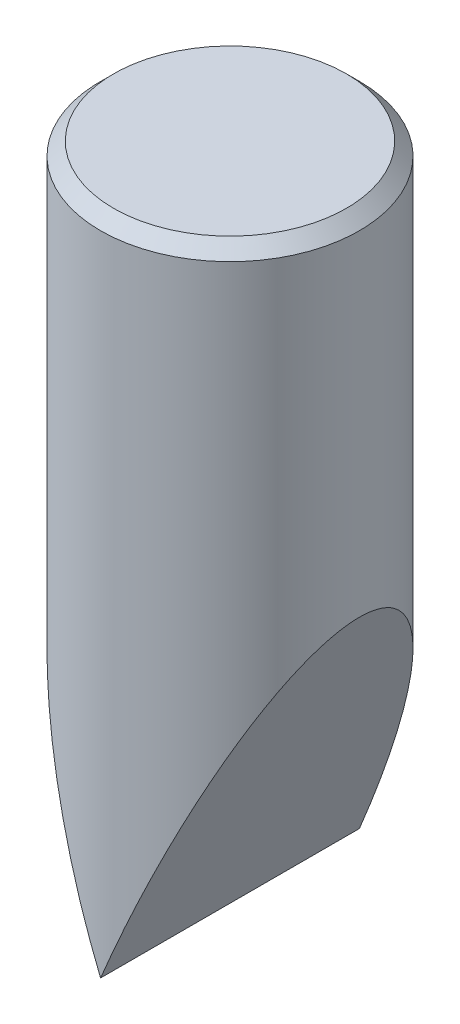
from build123d import *

# Parameters (mm, degrees)
SKETCH_1_R          = 5
EXTRUDE_1_DEPTH     = 25.5
CUT_EXTRUDE_1_DEPTH = 12.75
CHAMFER_1_SIZE      = 0.5


with BuildPart() as part:
    # Sketch 1 → Extrude 1 (new body)
    with BuildSketch(Plane(origin=(0, 0, 0), x_dir=(1, 0, 0), z_dir=(0, 1, 0))):
        with Locations(Location((0, 0, 0), (0, 0, 270))):
            Circle(SKETCH_1_R)
    extrude(amount=EXTRUDE_1_DEPTH)

    # Sketch 2 → Cut-Extrude 1 (cut, symmetric)
    with BuildSketch(Plane.XY):
        Polygon((0, 0), (5, 12.071067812), (5, -4.431271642), (-5, -4.431271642), (-5, 12.071067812), align=None)
    extrude(amount=CUT_EXTRUDE_1_DEPTH, both=True, mode=Mode.SUBTRACT)

    # Chamfer 1
    chamfer_1_edges = [part.edges().sort_by_distance(p)[0] for p in [
        (0, 25.5, -5),
    ]]
    chamfer(chamfer_1_edges, length=CHAMFER_1_SIZE)


solid = part.part
